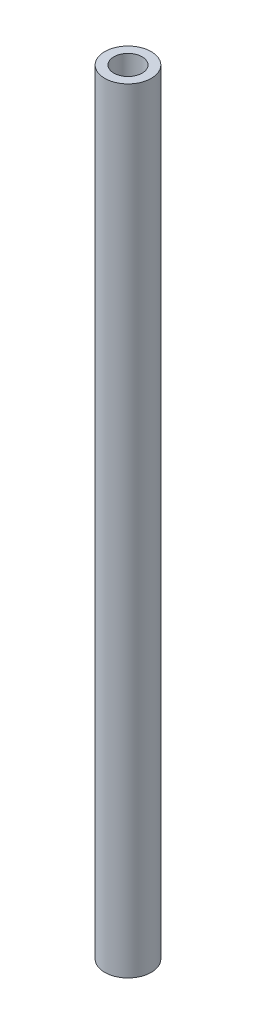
ISO-10303-21;
HEADER;
FILE_DESCRIPTION(('STEP AP214'),'2;1');
FILE_NAME('part.step','',(''),(''),'','','');
FILE_SCHEMA(('AUTOMOTIVE_DESIGN { 1 0 10303 214 1 1 1 1 }'));
ENDSEC;
DATA;
#1=APPLICATION_CONTEXT('core data for automotive mechanical design processes');
#2=APPLICATION_PROTOCOL_DEFINITION('international standard','automotive_design',2000,#1);
#3=PRODUCT_CONTEXT('',#1,'mechanical');
#4=PRODUCT('Part','Part','',(#3));
#5=PRODUCT_RELATED_PRODUCT_CATEGORY('part','',(#4));
#6=PRODUCT_DEFINITION_FORMATION('','',#4);
#7=PRODUCT_DEFINITION_CONTEXT('part definition',#1,'design');
#8=PRODUCT_DEFINITION('design','',#6,#7);
#9=PRODUCT_DEFINITION_SHAPE('','',#8);
#10=(LENGTH_UNIT() NAMED_UNIT(*) SI_UNIT(.MILLI.,.METRE.));
#11=(NAMED_UNIT(*) PLANE_ANGLE_UNIT() SI_UNIT($,.RADIAN.));
#12=(NAMED_UNIT(*) SI_UNIT($,.STERADIAN.) SOLID_ANGLE_UNIT());
#13=UNCERTAINTY_MEASURE_WITH_UNIT(LENGTH_MEASURE(1.E-05),#10,'distance_accuracy_value','');
#14=(GEOMETRIC_REPRESENTATION_CONTEXT(3) GLOBAL_UNCERTAINTY_ASSIGNED_CONTEXT((#13)) GLOBAL_UNIT_ASSIGNED_CONTEXT((#10,
#11,#12)) REPRESENTATION_CONTEXT('',''));
#15=CARTESIAN_POINT('',(0.,0.,0.));
#16=DIRECTION('',(0.,0.,1.));
#17=DIRECTION('',(1.,0.,0.));
#18=AXIS2_PLACEMENT_3D('',#15,#16,#17);
#19=CARTESIAN_POINT('',(0.,119.706546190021,0.));
#20=DIRECTION('',(0.,1.,0.));
#21=DIRECTION('',(0.,0.,1.));
#22=AXIS2_PLACEMENT_3D('',#19,#20,#21);
#23=CYLINDRICAL_SURFACE('',#22,15.);
#24=CARTESIAN_POINT('',(0.,500.,0.));
#25=DIRECTION('',(0.,1.,0.));
#26=DIRECTION('',(0.,0.,1.));
#27=AXIS2_PLACEMENT_3D('',#24,#25,#26);
#28=CIRCLE('',#27,15.);
#29=CARTESIAN_POINT('',(0.,500.,15.));
#30=VERTEX_POINT('',#29);
#31=EDGE_CURVE('E42',#30,#30,#28,.T.);
#32=ORIENTED_EDGE('',*,*,#31,.F.);
#33=EDGE_LOOP('',(#32));
#34=FACE_BOUND('',#33,.T.);
#35=CARTESIAN_POINT('',(0.,0.,0.));
#36=DIRECTION('',(0.,1.,0.));
#37=DIRECTION('',(0.,0.,1.));
#38=AXIS2_PLACEMENT_3D('',#35,#36,#37);
#39=CIRCLE('',#38,15.);
#40=CARTESIAN_POINT('',(0.,0.,15.));
#41=VERTEX_POINT('',#40);
#42=EDGE_CURVE('E10',#41,#41,#39,.T.);
#43=ORIENTED_EDGE('',*,*,#42,.T.);
#44=EDGE_LOOP('',(#43));
#45=FACE_BOUND('',#44,.T.);
#46=ADVANCED_FACE('F28',(#34,#45),#23,.T.);
#47=CARTESIAN_POINT('',(15.,0.,0.));
#48=DIRECTION('',(0.,1.,0.));
#49=DIRECTION('',(0.,0.,1.));
#50=AXIS2_PLACEMENT_3D('',#47,#48,#49);
#51=PLANE('',#50);
#52=ORIENTED_EDGE('',*,*,#42,.F.);
#53=EDGE_LOOP('',(#52));
#54=FACE_BOUND('',#53,.T.);
#55=CARTESIAN_POINT('',(0.,0.,0.));
#56=DIRECTION('',(0.,1.,0.));
#57=DIRECTION('',(0.,0.,1.));
#58=AXIS2_PLACEMENT_3D('',#55,#56,#57);
#59=CIRCLE('',#58,9.15000000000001);
#60=CARTESIAN_POINT('',(0.,0.,9.15000000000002));
#61=VERTEX_POINT('',#60);
#62=EDGE_CURVE('E34',#61,#61,#59,.T.);
#63=ORIENTED_EDGE('',*,*,#62,.T.);
#64=EDGE_LOOP('',(#63));
#65=FACE_BOUND('',#64,.T.);
#66=ADVANCED_FACE('F51',(#54,#65),#51,.F.);
#67=CARTESIAN_POINT('',(0.,119.706546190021,0.));
#68=DIRECTION('',(0.,1.,0.));
#69=DIRECTION('',(0.,0.,1.));
#70=AXIS2_PLACEMENT_3D('',#67,#68,#69);
#71=CYLINDRICAL_SURFACE('',#70,9.14999999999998);
#72=ORIENTED_EDGE('',*,*,#62,.F.);
#73=EDGE_LOOP('',(#72));
#74=FACE_BOUND('',#73,.T.);
#75=CARTESIAN_POINT('',(0.,500.,0.));
#76=DIRECTION('',(0.,1.,0.));
#77=DIRECTION('',(0.,0.,1.));
#78=AXIS2_PLACEMENT_3D('',#75,#76,#77);
#79=CIRCLE('',#78,9.14999999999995);
#80=CARTESIAN_POINT('',(0.,500.,9.14999999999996));
#81=VERTEX_POINT('',#80);
#82=EDGE_CURVE('E38',#81,#81,#79,.T.);
#83=ORIENTED_EDGE('',*,*,#82,.T.);
#84=EDGE_LOOP('',(#83));
#85=FACE_BOUND('',#84,.T.);
#86=ADVANCED_FACE('F55',(#74,#85),#71,.F.);
#87=CARTESIAN_POINT('',(15.,500.,0.));
#88=DIRECTION('',(0.,-1.,0.));
#89=DIRECTION('',(0.,0.,-1.));
#90=AXIS2_PLACEMENT_3D('',#87,#88,#89);
#91=PLANE('',#90);
#92=ORIENTED_EDGE('',*,*,#82,.F.);
#93=EDGE_LOOP('',(#92));
#94=FACE_BOUND('',#93,.T.);
#95=ORIENTED_EDGE('',*,*,#31,.T.);
#96=EDGE_LOOP('',(#95));
#97=FACE_BOUND('',#96,.T.);
#98=ADVANCED_FACE('F48',(#94,#97),#91,.F.);
#99=CLOSED_SHELL('',(#46,#66,#86,#98));
#100=MANIFOLD_SOLID_BREP('B2',#99);
#101=ADVANCED_BREP_SHAPE_REPRESENTATION('',(#18,#100),#14);
#102=SHAPE_DEFINITION_REPRESENTATION(#9,#101);
ENDSEC;
END-ISO-10303-21;
